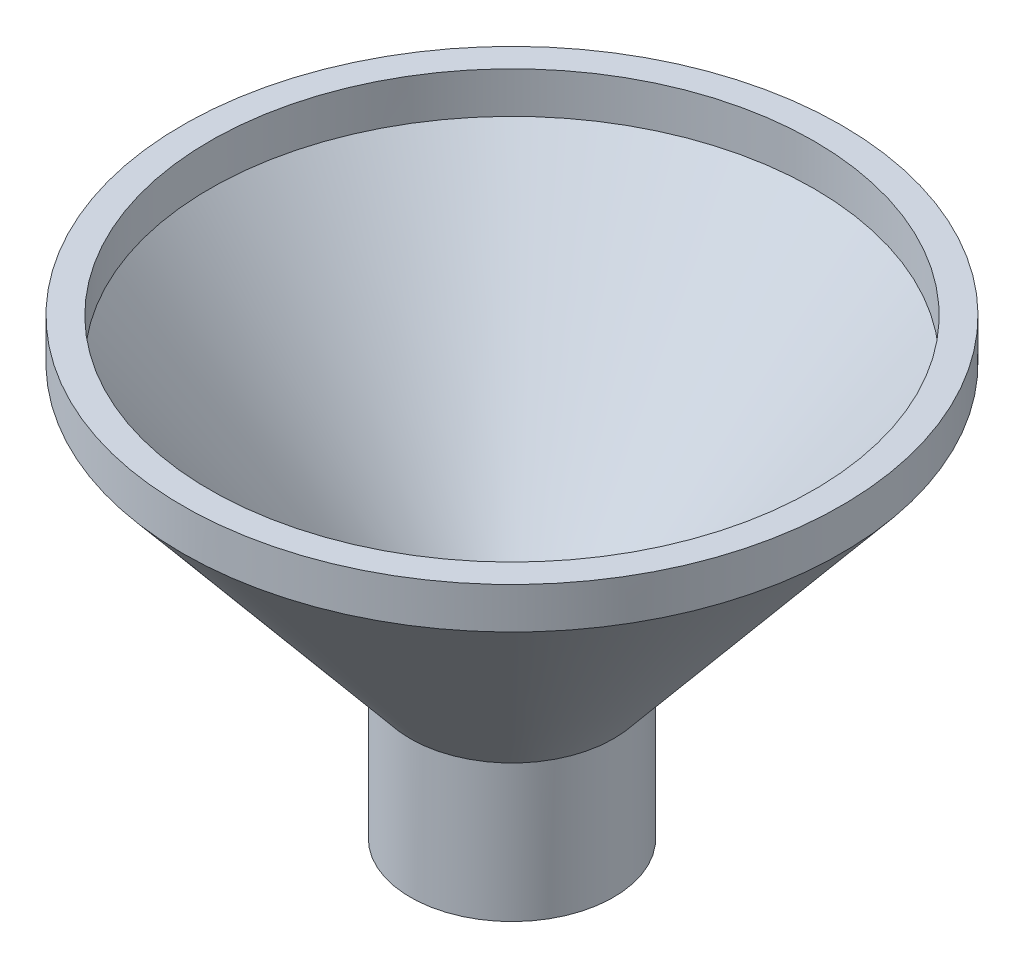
ISO-10303-21;
HEADER;
FILE_DESCRIPTION(('STEP AP214'),'2;1');
FILE_NAME('part.step','',(''),(''),'','','');
FILE_SCHEMA(('AUTOMOTIVE_DESIGN { 1 0 10303 214 1 1 1 1 }'));
ENDSEC;
DATA;
#1=APPLICATION_CONTEXT('core data for automotive mechanical design processes');
#2=APPLICATION_PROTOCOL_DEFINITION('international standard','automotive_design',2000,#1);
#3=PRODUCT_CONTEXT('',#1,'mechanical');
#4=PRODUCT('Part','Part','',(#3));
#5=PRODUCT_RELATED_PRODUCT_CATEGORY('part','',(#4));
#6=PRODUCT_DEFINITION_FORMATION('','',#4);
#7=PRODUCT_DEFINITION_CONTEXT('part definition',#1,'design');
#8=PRODUCT_DEFINITION('design','',#6,#7);
#9=PRODUCT_DEFINITION_SHAPE('','',#8);
#10=(LENGTH_UNIT() NAMED_UNIT(*) SI_UNIT(.MILLI.,.METRE.));
#11=(NAMED_UNIT(*) PLANE_ANGLE_UNIT() SI_UNIT($,.RADIAN.));
#12=(NAMED_UNIT(*) SI_UNIT($,.STERADIAN.) SOLID_ANGLE_UNIT());
#13=UNCERTAINTY_MEASURE_WITH_UNIT(LENGTH_MEASURE(1.E-05),#10,'distance_accuracy_value','');
#14=(GEOMETRIC_REPRESENTATION_CONTEXT(3) GLOBAL_UNCERTAINTY_ASSIGNED_CONTEXT((#13)) GLOBAL_UNIT_ASSIGNED_CONTEXT((#10,
#11,#12)) REPRESENTATION_CONTEXT('',''));
#15=CARTESIAN_POINT('',(0.,0.,0.));
#16=DIRECTION('',(0.,0.,1.));
#17=DIRECTION('',(1.,0.,0.));
#18=AXIS2_PLACEMENT_3D('',#15,#16,#17);
#19=CARTESIAN_POINT('',(0.,150.,0.));
#20=DIRECTION('',(0.,1.,0.));
#21=DIRECTION('',(0.,0.,1.));
#22=AXIS2_PLACEMENT_3D('',#19,#20,#21);
#23=CONICAL_SURFACE('',#22,120.,0.692767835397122);
#24=CARTESIAN_POINT('',(0.,50.,0.));
#25=DIRECTION('',(0.,-1.,0.));
#26=DIRECTION('',(0.,0.,-1.));
#27=AXIS2_PLACEMENT_3D('',#24,#25,#26);
#28=CIRCLE('',#27,37.);
#29=CARTESIAN_POINT('',(0.,50.,37.));
#30=VERTEX_POINT('',#29);
#31=EDGE_CURVE('E60',#30,#30,#28,.T.);
#32=CARTESIAN_POINT('',(0.,150.,0.));
#33=DIRECTION('',(0.,-1.,0.));
#34=DIRECTION('',(0.,0.,-1.));
#35=AXIS2_PLACEMENT_3D('',#32,#33,#34);
#36=CIRCLE('',#35,120.);
#37=CARTESIAN_POINT('',(0.,150.,120.));
#38=VERTEX_POINT('',#37);
#39=EDGE_CURVE('E10',#38,#38,#36,.T.);
#40=CARTESIAN_POINT('',(0.,50.,37.));
#41=CARTESIAN_POINT('',(0.,51.0416666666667,37.8645833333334));
#42=CARTESIAN_POINT('',(0.,52.0833333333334,38.7291666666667));
#43=CARTESIAN_POINT('',(0.,54.1666666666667,40.4583333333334));
#44=CARTESIAN_POINT('',(0.,55.2083333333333,41.3229166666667));
#45=CARTESIAN_POINT('',(0.,57.2916666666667,43.0520833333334));
#46=CARTESIAN_POINT('',(0.,58.3333333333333,43.9166666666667));
#47=CARTESIAN_POINT('',(0.,60.4166666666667,45.6458333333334));
#48=CARTESIAN_POINT('',(0.,61.4583333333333,46.5104166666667));
#49=CARTESIAN_POINT('',(0.,63.5416666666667,48.2395833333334));
#50=CARTESIAN_POINT('',(0.,64.5833333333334,49.1041666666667));
#51=CARTESIAN_POINT('',(0.,66.6666666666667,50.8333333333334));
#52=CARTESIAN_POINT('',(0.,67.7083333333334,51.6979166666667));
#53=CARTESIAN_POINT('',(0.,69.7916666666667,53.4270833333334));
#54=CARTESIAN_POINT('',(0.,70.8333333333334,54.2916666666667));
#55=CARTESIAN_POINT('',(0.,72.9166666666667,56.0208333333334));
#56=CARTESIAN_POINT('',(0.,73.9583333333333,56.8854166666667));
#57=CARTESIAN_POINT('',(0.,76.0416666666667,58.6145833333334));
#58=CARTESIAN_POINT('',(0.,77.0833333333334,59.4791666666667));
#59=CARTESIAN_POINT('',(0.,79.1666666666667,61.2083333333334));
#60=CARTESIAN_POINT('',(0.,80.2083333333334,62.0729166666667));
#61=CARTESIAN_POINT('',(0.,82.2916666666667,63.8020833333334));
#62=CARTESIAN_POINT('',(0.,83.3333333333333,64.6666666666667));
#63=CARTESIAN_POINT('',(0.,85.4166666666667,66.3958333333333));
#64=CARTESIAN_POINT('',(0.,86.4583333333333,67.2604166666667));
#65=CARTESIAN_POINT('',(0.,88.5416666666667,68.9895833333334));
#66=CARTESIAN_POINT('',(0.,89.5833333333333,69.8541666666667));
#67=CARTESIAN_POINT('',(0.,91.6666666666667,71.5833333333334));
#68=CARTESIAN_POINT('',(0.,92.7083333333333,72.4479166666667));
#69=CARTESIAN_POINT('',(0.,94.7916666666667,74.1770833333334));
#70=CARTESIAN_POINT('',(0.,95.8333333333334,75.0416666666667));
#71=CARTESIAN_POINT('',(0.,97.9166666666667,76.7708333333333));
#72=CARTESIAN_POINT('',(0.,98.9583333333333,77.6354166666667));
#73=CARTESIAN_POINT('',(0.,101.041666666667,79.3645833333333));
#74=CARTESIAN_POINT('',(0.,102.083333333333,80.2291666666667));
#75=CARTESIAN_POINT('',(0.,104.166666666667,81.9583333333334));
#76=CARTESIAN_POINT('',(0.,105.208333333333,82.8229166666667));
#77=CARTESIAN_POINT('',(0.,107.291666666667,84.5520833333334));
#78=CARTESIAN_POINT('',(0.,108.333333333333,85.4166666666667));
#79=CARTESIAN_POINT('',(0.,110.416666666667,87.1458333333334));
#80=CARTESIAN_POINT('',(0.,111.458333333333,88.0104166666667));
#81=CARTESIAN_POINT('',(0.,113.541666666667,89.7395833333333));
#82=CARTESIAN_POINT('',(0.,114.583333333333,90.6041666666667));
#83=CARTESIAN_POINT('',(0.,116.666666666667,92.3333333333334));
#84=CARTESIAN_POINT('',(0.,117.708333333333,93.1979166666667));
#85=CARTESIAN_POINT('',(0.,119.791666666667,94.9270833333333));
#86=CARTESIAN_POINT('',(0.,120.833333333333,95.7916666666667));
#87=CARTESIAN_POINT('',(0.,122.916666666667,97.5208333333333));
#88=CARTESIAN_POINT('',(0.,123.958333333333,98.3854166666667));
#89=CARTESIAN_POINT('',(0.,126.041666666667,100.114583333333));
#90=CARTESIAN_POINT('',(0.,127.083333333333,100.979166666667));
#91=CARTESIAN_POINT('',(0.,129.166666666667,102.708333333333));
#92=CARTESIAN_POINT('',(0.,130.208333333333,103.572916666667));
#93=CARTESIAN_POINT('',(0.,132.291666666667,105.302083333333));
#94=CARTESIAN_POINT('',(0.,133.333333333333,106.166666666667));
#95=CARTESIAN_POINT('',(0.,135.416666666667,107.895833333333));
#96=CARTESIAN_POINT('',(0.,136.458333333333,108.760416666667));
#97=CARTESIAN_POINT('',(0.,138.541666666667,110.489583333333));
#98=CARTESIAN_POINT('',(0.,139.583333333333,111.354166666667));
#99=CARTESIAN_POINT('',(0.,141.666666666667,113.083333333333));
#100=CARTESIAN_POINT('',(0.,142.708333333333,113.947916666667));
#101=CARTESIAN_POINT('',(0.,144.791666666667,115.677083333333));
#102=CARTESIAN_POINT('',(0.,145.833333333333,116.541666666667));
#103=CARTESIAN_POINT('',(0.,147.916666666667,118.270833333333));
#104=CARTESIAN_POINT('',(0.,148.958333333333,119.135416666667));
#105=CARTESIAN_POINT('',(0.,150.,120.));
#106=B_SPLINE_CURVE_WITH_KNOTS('',3,(#40,#41,#42,#43,#44,#45,#46,#47,#48,#49,#50,#51,#52,#53,
#54,#55,#56,#57,#58,#59,#60,#61,#62,#63,#64,#65,#66,#67,#68,#69,#70,#71,#72,#73,#74,#75,#76,#77,
#78,#79,#80,#81,#82,#83,#84,#85,#86,#87,#88,#89,#90,#91,#92,#93,#94,#95,#96,#97,#98,#99,#100,
#101,#102,#103,#104,#105),.UNSPECIFIED.,.F.,.F.,(4,2,2,2,2,2,2,2,2,2,2,2,2,2,2,2,2,2,2,2,2,2,2,
2,2,2,2,2,2,2,2,2,4),(0.,4.06117766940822,8.12235533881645,12.1835330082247,16.2447106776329,
20.3058883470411,24.3670660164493,28.4282436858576,32.4894213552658,36.550599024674,
40.6117766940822,44.6729543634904,48.7341320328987,52.7953097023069,56.8564873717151,
60.9176650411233,64.9788427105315,69.0400203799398,73.101198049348,77.1623757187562,
81.2235533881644,85.2847310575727,89.3459087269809,93.4070863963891,97.4682640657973,
101.529441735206,105.590619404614,109.651797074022,113.71297474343,117.774152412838,
121.835330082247,125.896507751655,129.957685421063),.UNSPECIFIED.);
#107=EDGE_CURVE('BSEAM32',#30,#38,#106,.T.);
#108=ORIENTED_EDGE('',*,*,#31,.F.);
#109=ORIENTED_EDGE('',*,*,#39,.T.);
#110=ORIENTED_EDGE('',*,*,#107,.T.);
#111=ORIENTED_EDGE('',*,*,#107,.F.);
#112=EDGE_LOOP('',(#108,#110,#109,#111));
#113=FACE_BOUND('',#112,.T.);
#114=ADVANCED_FACE('F32',(#113),#23,.T.);
#115=CARTESIAN_POINT('',(0.,0.,0.));
#116=DIRECTION('',(0.,-1.,0.));
#117=DIRECTION('',(0.,0.,-1.));
#118=AXIS2_PLACEMENT_3D('',#115,#116,#117);
#119=CYLINDRICAL_SURFACE('',#118,120.);
#120=ORIENTED_EDGE('',*,*,#39,.F.);
#121=EDGE_LOOP('',(#120));
#122=FACE_BOUND('',#121,.T.);
#123=CARTESIAN_POINT('',(0.,165.,0.));
#124=DIRECTION('',(0.,-1.,0.));
#125=DIRECTION('',(0.,0.,-1.));
#126=AXIS2_PLACEMENT_3D('',#123,#124,#125);
#127=CIRCLE('',#126,120.);
#128=CARTESIAN_POINT('',(0.,165.,-120.));
#129=VERTEX_POINT('',#128);
#130=EDGE_CURVE('E38',#129,#129,#127,.T.);
#131=ORIENTED_EDGE('',*,*,#130,.T.);
#132=EDGE_LOOP('',(#131));
#133=FACE_BOUND('',#132,.T.);
#134=ADVANCED_FACE('F137',(#122,#133),#119,.T.);
#135=CARTESIAN_POINT('',(0.,165.,0.));
#136=DIRECTION('',(0.,-1.,0.));
#137=DIRECTION('',(0.,0.,-1.));
#138=AXIS2_PLACEMENT_3D('',#135,#136,#137);
#139=PLANE('',#138);
#140=ORIENTED_EDGE('',*,*,#130,.F.);
#141=EDGE_LOOP('',(#140));
#142=FACE_BOUND('',#141,.T.);
#143=CARTESIAN_POINT('',(0.,165.,0.));
#144=DIRECTION('',(0.,-1.,0.));
#145=DIRECTION('',(0.,0.,-1.));
#146=AXIS2_PLACEMENT_3D('',#143,#144,#145);
#147=CIRCLE('',#146,110.);
#148=CARTESIAN_POINT('',(0.,165.,-110.));
#149=VERTEX_POINT('',#148);
#150=EDGE_CURVE('E42',#149,#149,#147,.T.);
#151=ORIENTED_EDGE('',*,*,#150,.T.);
#152=EDGE_LOOP('',(#151));
#153=FACE_BOUND('',#152,.T.);
#154=ADVANCED_FACE('F134',(#142,#153),#139,.F.);
#155=CARTESIAN_POINT('',(0.,0.,0.));
#156=DIRECTION('',(0.,-1.,0.));
#157=DIRECTION('',(0.,0.,-1.));
#158=AXIS2_PLACEMENT_3D('',#155,#156,#157);
#159=CYLINDRICAL_SURFACE('',#158,110.);
#160=ORIENTED_EDGE('',*,*,#150,.F.);
#161=EDGE_LOOP('',(#160));
#162=FACE_BOUND('',#161,.T.);
#163=CARTESIAN_POINT('',(0.,150.,0.));
#164=DIRECTION('',(0.,-1.,0.));
#165=DIRECTION('',(0.,0.,-1.));
#166=AXIS2_PLACEMENT_3D('',#163,#164,#165);
#167=CIRCLE('',#166,110.);
#168=CARTESIAN_POINT('',(0.,150.,110.));
#169=VERTEX_POINT('',#168);
#170=EDGE_CURVE('E46',#169,#169,#167,.T.);
#171=ORIENTED_EDGE('',*,*,#170,.T.);
#172=EDGE_LOOP('',(#171));
#173=FACE_BOUND('',#172,.T.);
#174=ADVANCED_FACE('F130',(#162,#173),#159,.F.);
#175=CARTESIAN_POINT('',(0.,150.,0.));
#176=DIRECTION('',(0.,1.,0.));
#177=DIRECTION('',(0.,0.,1.));
#178=AXIS2_PLACEMENT_3D('',#175,#176,#177);
#179=CONICAL_SURFACE('',#178,110.,0.692767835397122);
#180=CARTESIAN_POINT('',(0.,50.,0.));
#181=DIRECTION('',(0.,-1.,0.));
#182=DIRECTION('',(0.,0.,-1.));
#183=AXIS2_PLACEMENT_3D('',#180,#181,#182);
#184=CIRCLE('',#183,27.);
#185=CARTESIAN_POINT('',(0.,50.,27.));
#186=VERTEX_POINT('',#185);
#187=EDGE_CURVE('E51',#186,#186,#184,.T.);
#188=CARTESIAN_POINT('',(0.,50.,27.));
#189=CARTESIAN_POINT('',(0.,51.0416666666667,27.8645833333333));
#190=CARTESIAN_POINT('',(0.,52.0833333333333,28.7291666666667));
#191=CARTESIAN_POINT('',(0.,54.1666666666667,30.4583333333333));
#192=CARTESIAN_POINT('',(0.,55.2083333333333,31.3229166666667));
#193=CARTESIAN_POINT('',(0.,57.2916666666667,33.0520833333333));
#194=CARTESIAN_POINT('',(0.,58.3333333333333,33.9166666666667));
#195=CARTESIAN_POINT('',(0.,60.4166666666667,35.6458333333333));
#196=CARTESIAN_POINT('',(0.,61.4583333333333,36.5104166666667));
#197=CARTESIAN_POINT('',(0.,63.5416666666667,38.2395833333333));
#198=CARTESIAN_POINT('',(0.,64.5833333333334,39.1041666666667));
#199=CARTESIAN_POINT('',(0.,66.6666666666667,40.8333333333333));
#200=CARTESIAN_POINT('',(0.,67.7083333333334,41.6979166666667));
#201=CARTESIAN_POINT('',(0.,69.7916666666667,43.4270833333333));
#202=CARTESIAN_POINT('',(0.,70.8333333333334,44.2916666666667));
#203=CARTESIAN_POINT('',(0.,72.9166666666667,46.0208333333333));
#204=CARTESIAN_POINT('',(0.,73.9583333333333,46.8854166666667));
#205=CARTESIAN_POINT('',(0.,76.0416666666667,48.6145833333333));
#206=CARTESIAN_POINT('',(0.,77.0833333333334,49.4791666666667));
#207=CARTESIAN_POINT('',(0.,79.1666666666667,51.2083333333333));
#208=CARTESIAN_POINT('',(0.,80.2083333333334,52.0729166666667));
#209=CARTESIAN_POINT('',(0.,82.2916666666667,53.8020833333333));
#210=CARTESIAN_POINT('',(0.,83.3333333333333,54.6666666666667));
#211=CARTESIAN_POINT('',(0.,85.4166666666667,56.3958333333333));
#212=CARTESIAN_POINT('',(0.,86.4583333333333,57.2604166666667));
#213=CARTESIAN_POINT('',(0.,88.5416666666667,58.9895833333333));
#214=CARTESIAN_POINT('',(0.,89.5833333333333,59.8541666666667));
#215=CARTESIAN_POINT('',(0.,91.6666666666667,61.5833333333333));
#216=CARTESIAN_POINT('',(0.,92.7083333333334,62.4479166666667));
#217=CARTESIAN_POINT('',(0.,94.7916666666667,64.1770833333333));
#218=CARTESIAN_POINT('',(0.,95.8333333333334,65.0416666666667));
#219=CARTESIAN_POINT('',(0.,97.9166666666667,66.7708333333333));
#220=CARTESIAN_POINT('',(0.,98.9583333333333,67.6354166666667));
#221=CARTESIAN_POINT('',(0.,101.041666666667,69.3645833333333));
#222=CARTESIAN_POINT('',(0.,102.083333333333,70.2291666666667));
#223=CARTESIAN_POINT('',(0.,104.166666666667,71.9583333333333));
#224=CARTESIAN_POINT('',(0.,105.208333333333,72.8229166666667));
#225=CARTESIAN_POINT('',(0.,107.291666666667,74.5520833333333));
#226=CARTESIAN_POINT('',(0.,108.333333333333,75.4166666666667));
#227=CARTESIAN_POINT('',(0.,110.416666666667,77.1458333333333));
#228=CARTESIAN_POINT('',(0.,111.458333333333,78.0104166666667));
#229=CARTESIAN_POINT('',(0.,113.541666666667,79.7395833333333));
#230=CARTESIAN_POINT('',(0.,114.583333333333,80.6041666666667));
#231=CARTESIAN_POINT('',(0.,116.666666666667,82.3333333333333));
#232=CARTESIAN_POINT('',(0.,117.708333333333,83.1979166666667));
#233=CARTESIAN_POINT('',(0.,119.791666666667,84.9270833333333));
#234=CARTESIAN_POINT('',(0.,120.833333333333,85.7916666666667));
#235=CARTESIAN_POINT('',(0.,122.916666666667,87.5208333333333));
#236=CARTESIAN_POINT('',(0.,123.958333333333,88.3854166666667));
#237=CARTESIAN_POINT('',(0.,126.041666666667,90.1145833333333));
#238=CARTESIAN_POINT('',(0.,127.083333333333,90.9791666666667));
#239=CARTESIAN_POINT('',(0.,129.166666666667,92.7083333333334));
#240=CARTESIAN_POINT('',(0.,130.208333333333,93.5729166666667));
#241=CARTESIAN_POINT('',(0.,132.291666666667,95.3020833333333));
#242=CARTESIAN_POINT('',(0.,133.333333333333,96.1666666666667));
#243=CARTESIAN_POINT('',(0.,135.416666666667,97.8958333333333));
#244=CARTESIAN_POINT('',(0.,136.458333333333,98.7604166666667));
#245=CARTESIAN_POINT('',(0.,138.541666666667,100.489583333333));
#246=CARTESIAN_POINT('',(0.,139.583333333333,101.354166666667));
#247=CARTESIAN_POINT('',(0.,141.666666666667,103.083333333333));
#248=CARTESIAN_POINT('',(0.,142.708333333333,103.947916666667));
#249=CARTESIAN_POINT('',(0.,144.791666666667,105.677083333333));
#250=CARTESIAN_POINT('',(0.,145.833333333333,106.541666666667));
#251=CARTESIAN_POINT('',(0.,147.916666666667,108.270833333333));
#252=CARTESIAN_POINT('',(0.,148.958333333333,109.135416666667));
#253=CARTESIAN_POINT('',(0.,150.,110.));
#254=B_SPLINE_CURVE_WITH_KNOTS('',3,(#188,#189,#190,#191,#192,#193,#194,#195,#196,#197,#198,
#199,#200,#201,#202,#203,#204,#205,#206,#207,#208,#209,#210,#211,#212,#213,#214,#215,#216,#217,
#218,#219,#220,#221,#222,#223,#224,#225,#226,#227,#228,#229,#230,#231,#232,#233,#234,#235,#236,
#237,#238,#239,#240,#241,#242,#243,#244,#245,#246,#247,#248,#249,#250,#251,#252,#253),
.UNSPECIFIED.,.F.,.F.,(4,2,2,2,2,2,2,2,2,2,2,2,2,2,2,2,2,2,2,2,2,2,2,2,2,2,2,2,2,2,2,2,4),(0.,
4.06117766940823,8.12235533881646,12.1835330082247,16.2447106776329,20.3058883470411,
24.3670660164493,28.4282436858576,32.4894213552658,36.550599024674,40.6117766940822,
44.6729543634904,48.7341320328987,52.7953097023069,56.8564873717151,60.9176650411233,
64.9788427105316,69.0400203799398,73.101198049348,77.1623757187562,81.2235533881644,
85.2847310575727,89.3459087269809,93.4070863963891,97.4682640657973,101.529441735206,
105.590619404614,109.651797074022,113.71297474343,117.774152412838,121.835330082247,
125.896507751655,129.957685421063),.UNSPECIFIED.);
#255=EDGE_CURVE('BSEAM126',#186,#169,#254,.T.);
#256=ORIENTED_EDGE('',*,*,#187,.T.);
#257=ORIENTED_EDGE('',*,*,#170,.F.);
#258=ORIENTED_EDGE('',*,*,#255,.T.);
#259=ORIENTED_EDGE('',*,*,#255,.F.);
#260=EDGE_LOOP('',(#256,#258,#257,#259));
#261=FACE_BOUND('',#260,.T.);
#262=ADVANCED_FACE('F126',(#261),#179,.F.);
#263=CARTESIAN_POINT('',(0.,0.,0.));
#264=DIRECTION('',(0.,-1.,0.));
#265=DIRECTION('',(0.,0.,-1.));
#266=AXIS2_PLACEMENT_3D('',#263,#264,#265);
#267=CYLINDRICAL_SURFACE('',#266,27.);
#268=ORIENTED_EDGE('',*,*,#187,.F.);
#269=EDGE_LOOP('',(#268));
#270=FACE_BOUND('',#269,.T.);
#271=CARTESIAN_POINT('',(0.,0.,0.));
#272=DIRECTION('',(0.,-1.,0.));
#273=DIRECTION('',(0.,0.,-1.));
#274=AXIS2_PLACEMENT_3D('',#271,#272,#273);
#275=CIRCLE('',#274,27.);
#276=CARTESIAN_POINT('',(0.,0.,-27.));
#277=VERTEX_POINT('',#276);
#278=EDGE_CURVE('E54',#277,#277,#275,.T.);
#279=ORIENTED_EDGE('',*,*,#278,.T.);
#280=EDGE_LOOP('',(#279));
#281=FACE_BOUND('',#280,.T.);
#282=ADVANCED_FACE('F122',(#270,#281),#267,.F.);
#283=CARTESIAN_POINT('',(0.,0.,0.));
#284=DIRECTION('',(0.,-1.,0.));
#285=DIRECTION('',(0.,0.,-1.));
#286=AXIS2_PLACEMENT_3D('',#283,#284,#285);
#287=PLANE('',#286);
#288=CARTESIAN_POINT('',(0.,0.,0.));
#289=DIRECTION('',(0.,-1.,0.));
#290=DIRECTION('',(0.,0.,-1.));
#291=AXIS2_PLACEMENT_3D('',#288,#289,#290);
#292=CIRCLE('',#291,37.);
#293=CARTESIAN_POINT('',(0.,0.,-37.));
#294=VERTEX_POINT('',#293);
#295=EDGE_CURVE('E57',#294,#294,#292,.T.);
#296=ORIENTED_EDGE('',*,*,#295,.T.);
#297=EDGE_LOOP('',(#296));
#298=FACE_BOUND('',#297,.T.);
#299=ORIENTED_EDGE('',*,*,#278,.F.);
#300=EDGE_LOOP('',(#299));
#301=FACE_BOUND('',#300,.T.);
#302=ADVANCED_FACE('F118',(#298,#301),#287,.T.);
#303=CARTESIAN_POINT('',(0.,0.,0.));
#304=DIRECTION('',(0.,-1.,0.));
#305=DIRECTION('',(0.,0.,-1.));
#306=AXIS2_PLACEMENT_3D('',#303,#304,#305);
#307=CYLINDRICAL_SURFACE('',#306,37.);
#308=ORIENTED_EDGE('',*,*,#295,.F.);
#309=EDGE_LOOP('',(#308));
#310=FACE_BOUND('',#309,.T.);
#311=ORIENTED_EDGE('',*,*,#31,.T.);
#312=EDGE_LOOP('',(#311));
#313=FACE_BOUND('',#312,.T.);
#314=ADVANCED_FACE('F116',(#310,#313),#307,.T.);
#315=CLOSED_SHELL('',(#114,#134,#154,#174,#262,#282,#302,#314));
#316=CARTESIAN_POINT('',(0.,150.360935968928,0.));
#317=DIRECTION('',(0.,1.,0.));
#318=DIRECTION('',(0.,0.,1.));
#319=AXIS2_PLACEMENT_3D('',#316,#317,#318);
#320=CONICAL_SURFACE('',#319,119.,0.692767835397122);
#321=CARTESIAN_POINT('',(0.,50.3609359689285,0.));
#322=DIRECTION('',(0.,-1.,0.));
#323=DIRECTION('',(0.,0.,-1.));
#324=AXIS2_PLACEMENT_3D('',#321,#322,#323);
#325=CIRCLE('',#324,36.);
#326=CARTESIAN_POINT('',(0.,50.3609359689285,36.));
#327=VERTEX_POINT('',#326);
#328=EDGE_CURVE('E84',#327,#327,#325,.T.);
#329=CARTESIAN_POINT('',(0.,150.360935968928,0.));
#330=DIRECTION('',(0.,-1.,0.));
#331=DIRECTION('',(0.,0.,-1.));
#332=AXIS2_PLACEMENT_3D('',#329,#330,#331);
#333=CIRCLE('',#332,119.);
#334=CARTESIAN_POINT('',(0.,150.360935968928,119.));
#335=VERTEX_POINT('',#334);
#336=EDGE_CURVE('E63',#335,#335,#333,.T.);
#337=CARTESIAN_POINT('',(0.,50.3609359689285,36.));
#338=CARTESIAN_POINT('',(0.,51.4026026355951,36.8645833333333));
#339=CARTESIAN_POINT('',(0.,52.4442693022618,37.7291666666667));
#340=CARTESIAN_POINT('',(0.,54.5276026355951,39.4583333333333));
#341=CARTESIAN_POINT('',(0.,55.5692693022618,40.3229166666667));
#342=CARTESIAN_POINT('',(0.,57.6526026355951,42.0520833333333));
#343=CARTESIAN_POINT('',(0.,58.6942693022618,42.9166666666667));
#344=CARTESIAN_POINT('',(0.,60.7776026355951,44.6458333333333));
#345=CARTESIAN_POINT('',(0.,61.8192693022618,45.5104166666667));
#346=CARTESIAN_POINT('',(0.,63.9026026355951,47.2395833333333));
#347=CARTESIAN_POINT('',(0.,64.9442693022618,48.1041666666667));
#348=CARTESIAN_POINT('',(0.,67.0276026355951,49.8333333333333));
#349=CARTESIAN_POINT('',(0.,68.0692693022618,50.6979166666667));
#350=CARTESIAN_POINT('',(0.,70.1526026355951,52.4270833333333));
#351=CARTESIAN_POINT('',(0.,71.1942693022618,53.2916666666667));
#352=CARTESIAN_POINT('',(0.,73.2776026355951,55.0208333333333));
#353=CARTESIAN_POINT('',(0.,74.3192693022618,55.8854166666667));
#354=CARTESIAN_POINT('',(0.,76.4026026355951,57.6145833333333));
#355=CARTESIAN_POINT('',(0.,77.4442693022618,58.4791666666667));
#356=CARTESIAN_POINT('',(0.,79.5276026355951,60.2083333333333));
#357=CARTESIAN_POINT('',(0.,80.5692693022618,61.0729166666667));
#358=CARTESIAN_POINT('',(0.,82.6526026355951,62.8020833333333));
#359=CARTESIAN_POINT('',(0.,83.6942693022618,63.6666666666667));
#360=CARTESIAN_POINT('',(0.,85.7776026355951,65.3958333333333));
#361=CARTESIAN_POINT('',(0.,86.8192693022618,66.2604166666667));
#362=CARTESIAN_POINT('',(0.,88.9026026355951,67.9895833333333));
#363=CARTESIAN_POINT('',(0.,89.9442693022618,68.8541666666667));
#364=CARTESIAN_POINT('',(0.,92.0276026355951,70.5833333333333));
#365=CARTESIAN_POINT('',(0.,93.0692693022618,71.4479166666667));
#366=CARTESIAN_POINT('',(0.,95.1526026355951,73.1770833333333));
#367=CARTESIAN_POINT('',(0.,96.1942693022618,74.0416666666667));
#368=CARTESIAN_POINT('',(0.,98.2776026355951,75.7708333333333));
#369=CARTESIAN_POINT('',(0.,99.3192693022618,76.6354166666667));
#370=CARTESIAN_POINT('',(0.,101.402602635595,78.3645833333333));
#371=CARTESIAN_POINT('',(0.,102.444269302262,79.2291666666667));
#372=CARTESIAN_POINT('',(0.,104.527602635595,80.9583333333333));
#373=CARTESIAN_POINT('',(0.,105.569269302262,81.8229166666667));
#374=CARTESIAN_POINT('',(0.,107.652602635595,83.5520833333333));
#375=CARTESIAN_POINT('',(0.,108.694269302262,84.4166666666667));
#376=CARTESIAN_POINT('',(0.,110.777602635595,86.1458333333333));
#377=CARTESIAN_POINT('',(0.,111.819269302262,87.0104166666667));
#378=CARTESIAN_POINT('',(0.,113.902602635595,88.7395833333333));
#379=CARTESIAN_POINT('',(0.,114.944269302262,89.6041666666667));
#380=CARTESIAN_POINT('',(0.,117.027602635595,91.3333333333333));
#381=CARTESIAN_POINT('',(0.,118.069269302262,92.1979166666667));
#382=CARTESIAN_POINT('',(0.,120.152602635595,93.9270833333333));
#383=CARTESIAN_POINT('',(0.,121.194269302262,94.7916666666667));
#384=CARTESIAN_POINT('',(0.,123.277602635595,96.5208333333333));
#385=CARTESIAN_POINT('',(0.,124.319269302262,97.3854166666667));
#386=CARTESIAN_POINT('',(0.,126.402602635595,99.1145833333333));
#387=CARTESIAN_POINT('',(0.,127.444269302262,99.9791666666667));
#388=CARTESIAN_POINT('',(0.,129.527602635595,101.708333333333));
#389=CARTESIAN_POINT('',(0.,130.569269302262,102.572916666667));
#390=CARTESIAN_POINT('',(0.,132.652602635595,104.302083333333));
#391=CARTESIAN_POINT('',(0.,133.694269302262,105.166666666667));
#392=CARTESIAN_POINT('',(0.,135.777602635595,106.895833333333));
#393=CARTESIAN_POINT('',(0.,136.819269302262,107.760416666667));
#394=CARTESIAN_POINT('',(0.,138.902602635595,109.489583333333));
#395=CARTESIAN_POINT('',(0.,139.944269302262,110.354166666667));
#396=CARTESIAN_POINT('',(0.,142.027602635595,112.083333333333));
#397=CARTESIAN_POINT('',(0.,143.069269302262,112.947916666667));
#398=CARTESIAN_POINT('',(0.,145.152602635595,114.677083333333));
#399=CARTESIAN_POINT('',(0.,146.194269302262,115.541666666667));
#400=CARTESIAN_POINT('',(0.,148.277602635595,117.270833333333));
#401=CARTESIAN_POINT('',(0.,149.319269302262,118.135416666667));
#402=CARTESIAN_POINT('',(0.,150.360935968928,119.));
#403=B_SPLINE_CURVE_WITH_KNOTS('',3,(#337,#338,#339,#340,#341,#342,#343,#344,#345,#346,#347,
#348,#349,#350,#351,#352,#353,#354,#355,#356,#357,#358,#359,#360,#361,#362,#363,#364,#365,#366,
#367,#368,#369,#370,#371,#372,#373,#374,#375,#376,#377,#378,#379,#380,#381,#382,#383,#384,#385,
#386,#387,#388,#389,#390,#391,#392,#393,#394,#395,#396,#397,#398,#399,#400,#401,#402),
.UNSPECIFIED.,.F.,.F.,(4,2,2,2,2,2,2,2,2,2,2,2,2,2,2,2,2,2,2,2,2,2,2,2,2,2,2,2,2,2,2,2,4),(0.,
4.06117766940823,8.12235533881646,12.1835330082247,16.2447106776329,20.3058883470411,
24.3670660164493,28.4282436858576,32.4894213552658,36.550599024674,40.6117766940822,
44.6729543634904,48.7341320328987,52.7953097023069,56.8564873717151,60.9176650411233,
64.9788427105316,69.0400203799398,73.101198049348,77.1623757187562,81.2235533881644,
85.2847310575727,89.3459087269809,93.4070863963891,97.4682640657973,101.529441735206,
105.590619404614,109.651797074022,113.71297474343,117.774152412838,121.835330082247,
125.896507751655,129.957685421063),.UNSPECIFIED.);
#404=EDGE_CURVE('BSEAM88',#327,#335,#403,.T.);
#405=ORIENTED_EDGE('',*,*,#328,.T.);
#406=ORIENTED_EDGE('',*,*,#336,.F.);
#407=ORIENTED_EDGE('',*,*,#404,.T.);
#408=ORIENTED_EDGE('',*,*,#404,.F.);
#409=EDGE_LOOP('',(#405,#407,#406,#408));
#410=FACE_BOUND('',#409,.T.);
#411=ADVANCED_FACE('F88',(#410),#320,.F.);
#412=CARTESIAN_POINT('',(0.,0.,0.));
#413=DIRECTION('',(0.,-1.,0.));
#414=DIRECTION('',(0.,0.,-1.));
#415=AXIS2_PLACEMENT_3D('',#412,#413,#414);
#416=CYLINDRICAL_SURFACE('',#415,119.);
#417=ORIENTED_EDGE('',*,*,#336,.T.);
#418=EDGE_LOOP('',(#417));
#419=FACE_BOUND('',#418,.T.);
#420=CARTESIAN_POINT('',(0.,164.,0.));
#421=DIRECTION('',(0.,-1.,0.));
#422=DIRECTION('',(0.,0.,-1.));
#423=AXIS2_PLACEMENT_3D('',#420,#421,#422);
#424=CIRCLE('',#423,119.);
#425=CARTESIAN_POINT('',(0.,164.,-119.));
#426=VERTEX_POINT('',#425);
#427=EDGE_CURVE('E66',#426,#426,#424,.T.);
#428=ORIENTED_EDGE('',*,*,#427,.F.);
#429=EDGE_LOOP('',(#428));
#430=FACE_BOUND('',#429,.T.);
#431=ADVANCED_FACE('F105',(#419,#430),#416,.F.);
#432=CARTESIAN_POINT('',(0.,164.,0.));
#433=DIRECTION('',(0.,-1.,0.));
#434=DIRECTION('',(0.,0.,-1.));
#435=AXIS2_PLACEMENT_3D('',#432,#433,#434);
#436=PLANE('',#435);
#437=ORIENTED_EDGE('',*,*,#427,.T.);
#438=EDGE_LOOP('',(#437));
#439=FACE_BOUND('',#438,.T.);
#440=CARTESIAN_POINT('',(0.,164.,0.));
#441=DIRECTION('',(0.,-1.,0.));
#442=DIRECTION('',(0.,0.,-1.));
#443=AXIS2_PLACEMENT_3D('',#440,#441,#442);
#444=CIRCLE('',#443,111.);
#445=CARTESIAN_POINT('',(0.,164.,-111.));
#446=VERTEX_POINT('',#445);
#447=EDGE_CURVE('E69',#446,#446,#444,.T.);
#448=ORIENTED_EDGE('',*,*,#447,.F.);
#449=EDGE_LOOP('',(#448));
#450=FACE_BOUND('',#449,.T.);
#451=ADVANCED_FACE('F111',(#439,#450),#436,.T.);
#452=CARTESIAN_POINT('',(0.,0.,0.));
#453=DIRECTION('',(0.,-1.,0.));
#454=DIRECTION('',(0.,0.,-1.));
#455=AXIS2_PLACEMENT_3D('',#452,#453,#454);
#456=CYLINDRICAL_SURFACE('',#455,111.);
#457=ORIENTED_EDGE('',*,*,#447,.T.);
#458=EDGE_LOOP('',(#457));
#459=FACE_BOUND('',#458,.T.);
#460=CARTESIAN_POINT('',(0.,149.639064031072,0.));
#461=DIRECTION('',(0.,-1.,0.));
#462=DIRECTION('',(0.,0.,-1.));
#463=AXIS2_PLACEMENT_3D('',#460,#461,#462);
#464=CIRCLE('',#463,111.);
#465=CARTESIAN_POINT('',(0.,149.639064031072,111.));
#466=VERTEX_POINT('',#465);
#467=EDGE_CURVE('E72',#466,#466,#464,.T.);
#468=ORIENTED_EDGE('',*,*,#467,.F.);
#469=EDGE_LOOP('',(#468));
#470=FACE_BOUND('',#469,.T.);
#471=ADVANCED_FACE('F208',(#459,#470),#456,.T.);
#472=CARTESIAN_POINT('',(0.,149.639064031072,0.));
#473=DIRECTION('',(0.,1.,0.));
#474=DIRECTION('',(0.,0.,1.));
#475=AXIS2_PLACEMENT_3D('',#472,#473,#474);
#476=CONICAL_SURFACE('',#475,111.,0.692767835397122);
#477=CARTESIAN_POINT('',(0.,49.6390640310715,0.));
#478=DIRECTION('',(0.,-1.,0.));
#479=DIRECTION('',(0.,0.,-1.));
#480=AXIS2_PLACEMENT_3D('',#477,#478,#479);
#481=CIRCLE('',#480,28.);
#482=CARTESIAN_POINT('',(0.,49.6390640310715,28.));
#483=VERTEX_POINT('',#482);
#484=EDGE_CURVE('E75',#483,#483,#481,.T.);
#485=CARTESIAN_POINT('',(0.,49.6390640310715,28.));
#486=CARTESIAN_POINT('',(0.,50.6807306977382,28.8645833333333));
#487=CARTESIAN_POINT('',(0.,51.7223973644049,29.7291666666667));
#488=CARTESIAN_POINT('',(0.,53.8057306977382,31.4583333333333));
#489=CARTESIAN_POINT('',(0.,54.8473973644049,32.3229166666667));
#490=CARTESIAN_POINT('',(0.,56.9307306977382,34.0520833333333));
#491=CARTESIAN_POINT('',(0.,57.9723973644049,34.9166666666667));
#492=CARTESIAN_POINT('',(0.,60.0557306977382,36.6458333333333));
#493=CARTESIAN_POINT('',(0.,61.0973973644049,37.5104166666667));
#494=CARTESIAN_POINT('',(0.,63.1807306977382,39.2395833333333));
#495=CARTESIAN_POINT('',(0.,64.2223973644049,40.1041666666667));
#496=CARTESIAN_POINT('',(0.,66.3057306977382,41.8333333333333));
#497=CARTESIAN_POINT('',(0.,67.3473973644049,42.6979166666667));
#498=CARTESIAN_POINT('',(0.,69.4307306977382,44.4270833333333));
#499=CARTESIAN_POINT('',(0.,70.4723973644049,45.2916666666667));
#500=CARTESIAN_POINT('',(0.,72.5557306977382,47.0208333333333));
#501=CARTESIAN_POINT('',(0.,73.5973973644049,47.8854166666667));
#502=CARTESIAN_POINT('',(0.,75.6807306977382,49.6145833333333));
#503=CARTESIAN_POINT('',(0.,76.7223973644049,50.4791666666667));
#504=CARTESIAN_POINT('',(0.,78.8057306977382,52.2083333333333));
#505=CARTESIAN_POINT('',(0.,79.8473973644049,53.0729166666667));
#506=CARTESIAN_POINT('',(0.,81.9307306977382,54.8020833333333));
#507=CARTESIAN_POINT('',(0.,82.9723973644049,55.6666666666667));
#508=CARTESIAN_POINT('',(0.,85.0557306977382,57.3958333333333));
#509=CARTESIAN_POINT('',(0.,86.0973973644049,58.2604166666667));
#510=CARTESIAN_POINT('',(0.,88.1807306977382,59.9895833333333));
#511=CARTESIAN_POINT('',(0.,89.2223973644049,60.8541666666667));
#512=CARTESIAN_POINT('',(0.,91.3057306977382,62.5833333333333));
#513=CARTESIAN_POINT('',(0.,92.3473973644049,63.4479166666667));
#514=CARTESIAN_POINT('',(0.,94.4307306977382,65.1770833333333));
#515=CARTESIAN_POINT('',(0.,95.4723973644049,66.0416666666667));
#516=CARTESIAN_POINT('',(0.,97.5557306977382,67.7708333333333));
#517=CARTESIAN_POINT('',(0.,98.5973973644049,68.6354166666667));
#518=CARTESIAN_POINT('',(0.,100.680730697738,70.3645833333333));
#519=CARTESIAN_POINT('',(0.,101.722397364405,71.2291666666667));
#520=CARTESIAN_POINT('',(0.,103.805730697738,72.9583333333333));
#521=CARTESIAN_POINT('',(0.,104.847397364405,73.8229166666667));
#522=CARTESIAN_POINT('',(0.,106.930730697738,75.5520833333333));
#523=CARTESIAN_POINT('',(0.,107.972397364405,76.4166666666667));
#524=CARTESIAN_POINT('',(0.,110.055730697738,78.1458333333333));
#525=CARTESIAN_POINT('',(0.,111.097397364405,79.0104166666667));
#526=CARTESIAN_POINT('',(0.,113.180730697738,80.7395833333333));
#527=CARTESIAN_POINT('',(0.,114.222397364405,81.6041666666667));
#528=CARTESIAN_POINT('',(0.,116.305730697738,83.3333333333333));
#529=CARTESIAN_POINT('',(0.,117.347397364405,84.1979166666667));
#530=CARTESIAN_POINT('',(0.,119.430730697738,85.9270833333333));
#531=CARTESIAN_POINT('',(0.,120.472397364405,86.7916666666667));
#532=CARTESIAN_POINT('',(0.,122.555730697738,88.5208333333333));
#533=CARTESIAN_POINT('',(0.,123.597397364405,89.3854166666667));
#534=CARTESIAN_POINT('',(0.,125.680730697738,91.1145833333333));
#535=CARTESIAN_POINT('',(0.,126.722397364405,91.9791666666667));
#536=CARTESIAN_POINT('',(0.,128.805730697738,93.7083333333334));
#537=CARTESIAN_POINT('',(0.,129.847397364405,94.5729166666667));
#538=CARTESIAN_POINT('',(0.,131.930730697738,96.3020833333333));
#539=CARTESIAN_POINT('',(0.,132.972397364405,97.1666666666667));
#540=CARTESIAN_POINT('',(0.,135.055730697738,98.8958333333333));
#541=CARTESIAN_POINT('',(0.,136.097397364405,99.7604166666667));
#542=CARTESIAN_POINT('',(0.,138.180730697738,101.489583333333));
#543=CARTESIAN_POINT('',(0.,139.222397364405,102.354166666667));
#544=CARTESIAN_POINT('',(0.,141.305730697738,104.083333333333));
#545=CARTESIAN_POINT('',(0.,142.347397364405,104.947916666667));
#546=CARTESIAN_POINT('',(0.,144.430730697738,106.677083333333));
#547=CARTESIAN_POINT('',(0.,145.472397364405,107.541666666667));
#548=CARTESIAN_POINT('',(0.,147.555730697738,109.270833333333));
#549=CARTESIAN_POINT('',(0.,148.597397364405,110.135416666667));
#550=CARTESIAN_POINT('',(0.,149.639064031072,111.));
#551=B_SPLINE_CURVE_WITH_KNOTS('',3,(#485,#486,#487,#488,#489,#490,#491,#492,#493,#494,#495,
#496,#497,#498,#499,#500,#501,#502,#503,#504,#505,#506,#507,#508,#509,#510,#511,#512,#513,#514,
#515,#516,#517,#518,#519,#520,#521,#522,#523,#524,#525,#526,#527,#528,#529,#530,#531,#532,#533,
#534,#535,#536,#537,#538,#539,#540,#541,#542,#543,#544,#545,#546,#547,#548,#549,#550),
.UNSPECIFIED.,.F.,.F.,(4,2,2,2,2,2,2,2,2,2,2,2,2,2,2,2,2,2,2,2,2,2,2,2,2,2,2,2,2,2,2,2,4),(0.,
4.06117766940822,8.12235533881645,12.1835330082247,16.2447106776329,20.3058883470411,
24.3670660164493,28.4282436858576,32.4894213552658,36.550599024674,40.6117766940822,
44.6729543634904,48.7341320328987,52.7953097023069,56.8564873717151,60.9176650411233,
64.9788427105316,69.0400203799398,73.101198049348,77.1623757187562,81.2235533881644,
85.2847310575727,89.3459087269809,93.4070863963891,97.4682640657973,101.529441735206,
105.590619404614,109.651797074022,113.71297474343,117.774152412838,121.835330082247,
125.896507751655,129.957685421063),.UNSPECIFIED.);
#552=EDGE_CURVE('BSEAM217',#483,#466,#551,.T.);
#553=ORIENTED_EDGE('',*,*,#484,.F.);
#554=ORIENTED_EDGE('',*,*,#467,.T.);
#555=ORIENTED_EDGE('',*,*,#552,.T.);
#556=ORIENTED_EDGE('',*,*,#552,.F.);
#557=EDGE_LOOP('',(#553,#555,#554,#556));
#558=FACE_BOUND('',#557,.T.);
#559=ADVANCED_FACE('F217',(#558),#476,.T.);
#560=CARTESIAN_POINT('',(0.,0.,0.));
#561=DIRECTION('',(0.,-1.,0.));
#562=DIRECTION('',(0.,0.,-1.));
#563=AXIS2_PLACEMENT_3D('',#560,#561,#562);
#564=CYLINDRICAL_SURFACE('',#563,28.);
#565=ORIENTED_EDGE('',*,*,#484,.T.);
#566=EDGE_LOOP('',(#565));
#567=FACE_BOUND('',#566,.T.);
#568=CARTESIAN_POINT('',(0.,1.,0.));
#569=DIRECTION('',(0.,-1.,0.));
#570=DIRECTION('',(0.,0.,-1.));
#571=AXIS2_PLACEMENT_3D('',#568,#569,#570);
#572=CIRCLE('',#571,28.);
#573=CARTESIAN_POINT('',(0.,1.,-28.));
#574=VERTEX_POINT('',#573);
#575=EDGE_CURVE('E78',#574,#574,#572,.T.);
#576=ORIENTED_EDGE('',*,*,#575,.F.);
#577=EDGE_LOOP('',(#576));
#578=FACE_BOUND('',#577,.T.);
#579=ADVANCED_FACE('F100',(#567,#578),#564,.T.);
#580=CARTESIAN_POINT('',(0.,1.,0.));
#581=DIRECTION('',(0.,-1.,0.));
#582=DIRECTION('',(0.,0.,-1.));
#583=AXIS2_PLACEMENT_3D('',#580,#581,#582);
#584=PLANE('',#583);
#585=CARTESIAN_POINT('',(0.,1.,0.));
#586=DIRECTION('',(0.,-1.,0.));
#587=DIRECTION('',(0.,0.,-1.));
#588=AXIS2_PLACEMENT_3D('',#585,#586,#587);
#589=CIRCLE('',#588,36.);
#590=CARTESIAN_POINT('',(0.,1.,-36.));
#591=VERTEX_POINT('',#590);
#592=EDGE_CURVE('E81',#591,#591,#589,.T.);
#593=ORIENTED_EDGE('',*,*,#592,.F.);
#594=EDGE_LOOP('',(#593));
#595=FACE_BOUND('',#594,.T.);
#596=ORIENTED_EDGE('',*,*,#575,.T.);
#597=EDGE_LOOP('',(#596));
#598=FACE_BOUND('',#597,.T.);
#599=ADVANCED_FACE('F93',(#595,#598),#584,.F.);
#600=CARTESIAN_POINT('',(0.,0.,0.));
#601=DIRECTION('',(0.,-1.,0.));
#602=DIRECTION('',(0.,0.,-1.));
#603=AXIS2_PLACEMENT_3D('',#600,#601,#602);
#604=CYLINDRICAL_SURFACE('',#603,36.);
#605=ORIENTED_EDGE('',*,*,#592,.T.);
#606=EDGE_LOOP('',(#605));
#607=FACE_BOUND('',#606,.T.);
#608=ORIENTED_EDGE('',*,*,#328,.F.);
#609=EDGE_LOOP('',(#608));
#610=FACE_BOUND('',#609,.T.);
#611=ADVANCED_FACE('F91',(#607,#610),#604,.F.);
#612=CLOSED_SHELL('',(#411,#431,#451,#471,#559,#579,#599,#611));
#613=ORIENTED_CLOSED_SHELL('',*,#612,.T.);
#614=BREP_WITH_VOIDS('B2',#315,(#613));
#615=ADVANCED_BREP_SHAPE_REPRESENTATION('',(#18,#614),#14);
#616=SHAPE_DEFINITION_REPRESENTATION(#9,#615);
ENDSEC;
END-ISO-10303-21;
